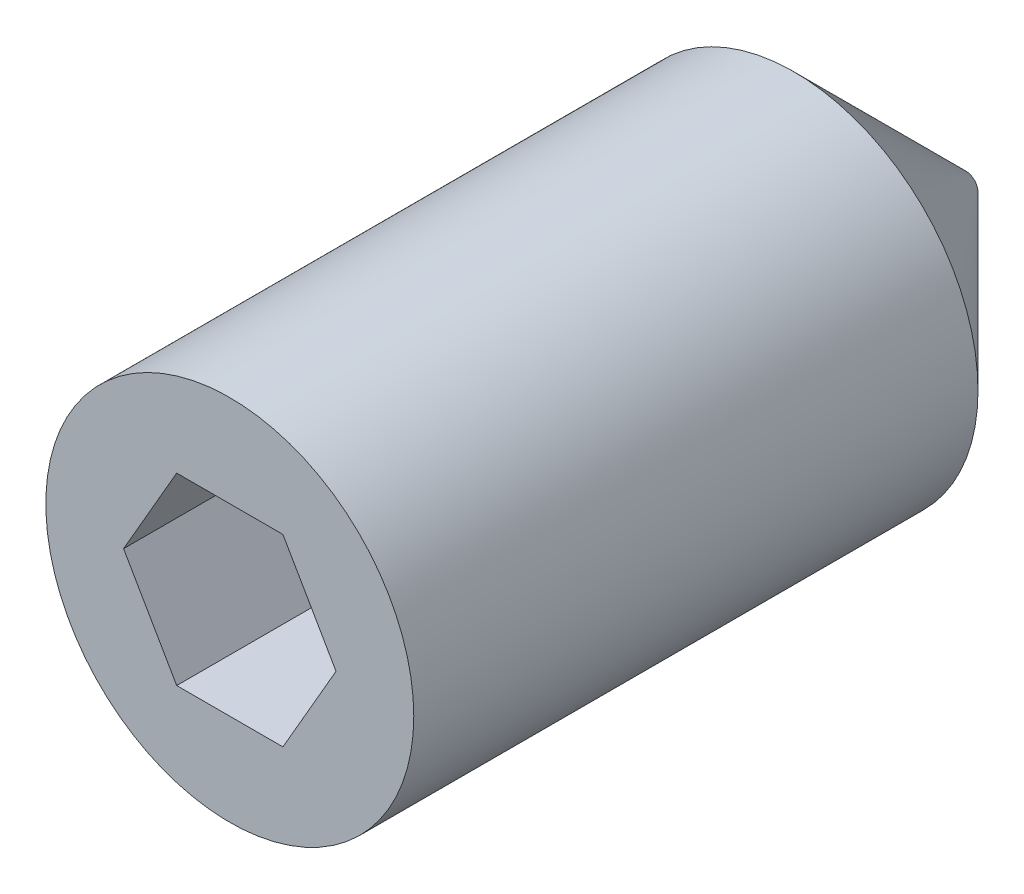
from build123d import *

# Parameters (mm, degrees)
SKETCH1_R           = 1.5
BOSS_EXTRUDE1_DEPTH = 6
CUT_EXTRUDE1_DEPTH  = 1.2


with BuildPart() as part:
    # Sketch1 → Boss-Extrude1 (new body)
    with BuildSketch(Plane.XY):
        Circle(SKETCH1_R)
    extrude(amount=-BOSS_EXTRUDE1_DEPTH)

    # Sketch2 → Cut-Extrude1 (cut)
    with BuildSketch(Plane.XY):
        Polygon((0.866025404, 0), (0.433012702, 0.75), (-0.433012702, 0.75), (-0.866025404, 0), (-0.433012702, -0.75), (0.433012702, -0.75), align=None)
    extrude(amount=-CUT_EXTRUDE1_DEPTH, mode=Mode.SUBTRACT)

    # Sketch3 → Chamfer 2 (revolve, cut)
    with BuildSketch(Plane(origin=(0, 0, 0), x_dir=(0, 0, -1), z_dir=(1, 0, 0)), mode=Mode.PRIVATE) as chamfer_2_sk:
        Polygon((6, 1.5), (6, 0.1), (4.6, 1.5), align=None)
    revolve(chamfer_2_sk.sketch.rotate(Axis((0, 0, 0), (0, 0, -1)), 90), axis=Axis((0, 0, 0), (0, 0, -1)), mode=Mode.SUBTRACT)


solid = part.part
